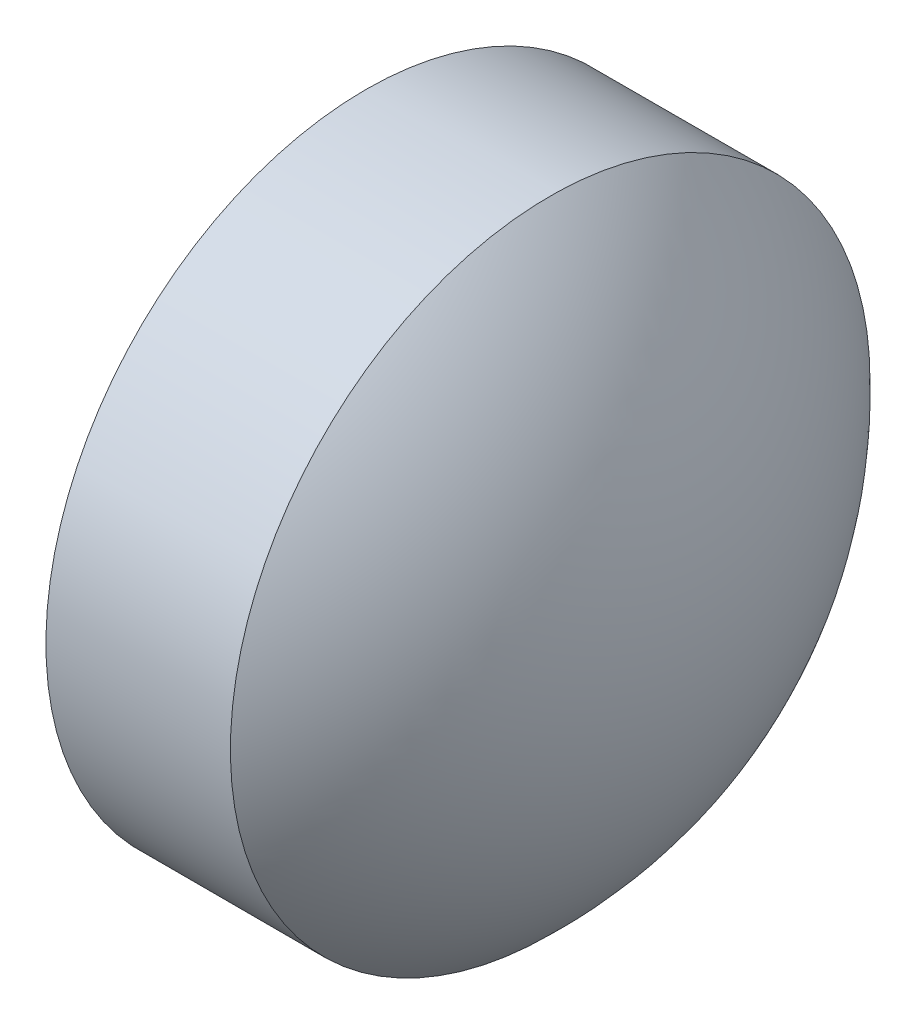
from build123d import *


with BuildPart() as part:
    # Skizze1 → Rotation1 (revolve)
    with BuildSketch(Plane.XY, mode=Mode.PRIVATE) as rotation1_sk:
        with BuildLine():
            Line((0, 0), (2.26, 0))
            ThreePointArc((2.26, 0), (2.063207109, 0.952954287), (1.505024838, 1.75))
            Line((1.505024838, 1.75), (0.495423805, 1.75))
            ThreePointArc((0.495423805, 1.75), (0.12624284, 0.909387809), (0, 0))
        make_face()
    revolve(rotation1_sk.sketch.rotate(Axis((0, 0, 0), (-1, 0, 0)), 90), axis=Axis((0, 0, 0), (-1, 0, 0)))


solid = part.part
